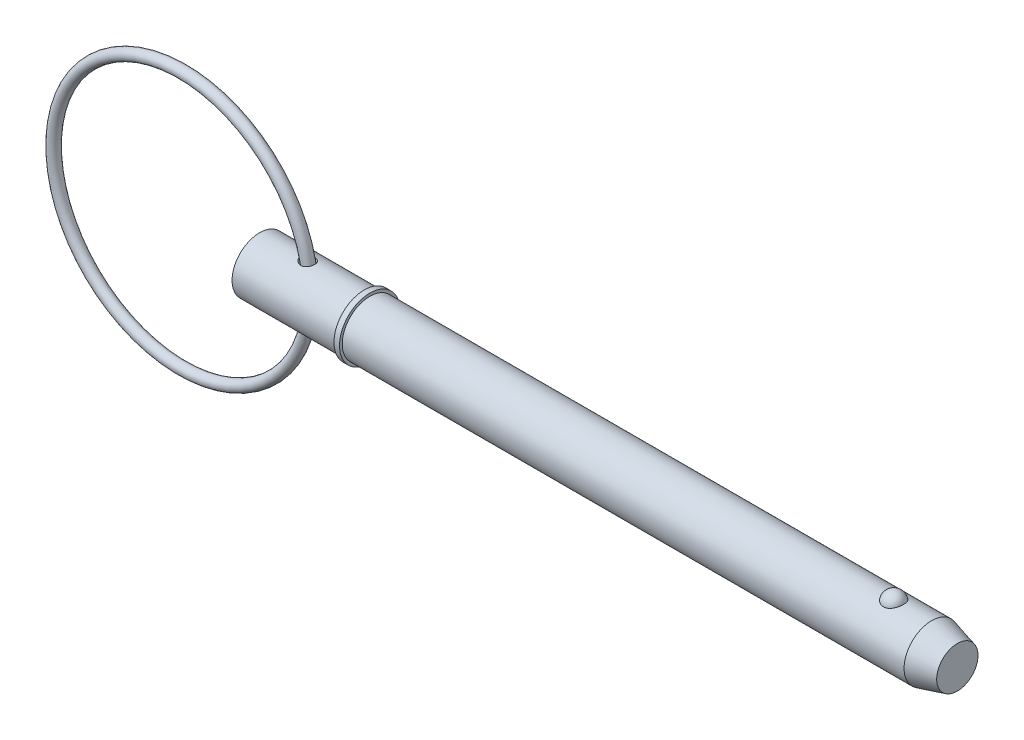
ISO-10303-21;
HEADER;
FILE_DESCRIPTION(('STEP AP214'),'2;1');
FILE_NAME('part.step','',(''),(''),'','','');
FILE_SCHEMA(('AUTOMOTIVE_DESIGN { 1 0 10303 214 1 1 1 1 }'));
ENDSEC;
DATA;
#1=APPLICATION_CONTEXT('core data for automotive mechanical design processes');
#2=APPLICATION_PROTOCOL_DEFINITION('international standard','automotive_design',2000,#1);
#3=PRODUCT_CONTEXT('',#1,'mechanical');
#4=PRODUCT('Part','Part','',(#3));
#5=PRODUCT_RELATED_PRODUCT_CATEGORY('part','',(#4));
#6=PRODUCT_DEFINITION_FORMATION('','',#4);
#7=PRODUCT_DEFINITION_CONTEXT('part definition',#1,'design');
#8=PRODUCT_DEFINITION('design','',#6,#7);
#9=PRODUCT_DEFINITION_SHAPE('','',#8);
#10=(LENGTH_UNIT() NAMED_UNIT(*) SI_UNIT(.MILLI.,.METRE.));
#11=(NAMED_UNIT(*) PLANE_ANGLE_UNIT() SI_UNIT($,.RADIAN.));
#12=(NAMED_UNIT(*) SI_UNIT($,.STERADIAN.) SOLID_ANGLE_UNIT());
#13=UNCERTAINTY_MEASURE_WITH_UNIT(LENGTH_MEASURE(1.E-05),#10,'distance_accuracy_value','');
#14=(GEOMETRIC_REPRESENTATION_CONTEXT(3) GLOBAL_UNCERTAINTY_ASSIGNED_CONTEXT((#13)) GLOBAL_UNIT_ASSIGNED_CONTEXT((#10,
#11,#12)) REPRESENTATION_CONTEXT('',''));
#15=CARTESIAN_POINT('',(0.,0.,0.));
#16=DIRECTION('',(0.,0.,1.));
#17=DIRECTION('',(1.,0.,0.));
#18=AXIS2_PLACEMENT_3D('',#15,#16,#17);
#19=CARTESIAN_POINT('',(-13.4013067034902,0.,0.));
#20=DIRECTION('',(0.,0.,1.));
#21=DIRECTION('',(1.,0.,0.));
#22=AXIS2_PLACEMENT_3D('',#19,#20,#21);
#23=TOROIDAL_SURFACE('',#22,22.225,0.952999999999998);
#24=CARTESIAN_POINT('',(9.77669329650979,0.,0.));
#25=VERTEX_POINT('',#24);
#26=VERTEX_LOOP('',#25);
#27=FACE_BOUND('',#26,.T.);
#28=ADVANCED_FACE('P0_F12',(#27),#23,.T.);
#29=CLOSED_SHELL('',(#28));
#30=MANIFOLD_SOLID_BREP('P0_B1',#29);
#31=CARTESIAN_POINT('',(0.,0.,0.));
#32=DIRECTION('',(1.,0.,0.));
#33=DIRECTION('',(0.,0.,-1.));
#34=AXIS2_PLACEMENT_3D('',#31,#32,#33);
#35=CYLINDRICAL_SURFACE('',#34,4.765);
#36=CARTESIAN_POINT('',(7.48459594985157,4.685973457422,-0.864220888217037));
#37=CARTESIAN_POINT('',(7.53849733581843,4.67711144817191,-0.912273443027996));
#38=CARTESIAN_POINT('',(7.59654891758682,4.66833039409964,-0.955745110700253));
#39=CARTESIAN_POINT('',(7.71924602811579,4.65195567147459,-1.03251233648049));
#40=CARTESIAN_POINT('',(7.78389917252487,4.64436340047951,-1.06579596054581));
#41=CARTESIAN_POINT('',(7.91808098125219,4.63129108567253,-1.12124172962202));
#42=CARTESIAN_POINT('',(7.98761280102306,4.62581242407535,-1.14339659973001));
#43=CARTESIAN_POINT('',(8.12956198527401,4.61771699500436,-1.17566870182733));
#44=CARTESIAN_POINT('',(8.20197774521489,4.61509865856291,-1.18579253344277));
#45=CARTESIAN_POINT('',(8.34550810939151,4.6131791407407,-1.19323853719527));
#46=CARTESIAN_POINT('',(8.41660306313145,4.61378793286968,-1.19090812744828));
#47=CARTESIAN_POINT('',(8.55721866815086,4.61812874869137,-1.17396277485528));
#48=CARTESIAN_POINT('',(8.62673979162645,4.62185982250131,-1.15935156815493));
#49=CARTESIAN_POINT('',(8.75801373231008,4.63172632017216,-1.11925454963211));
#50=CARTESIAN_POINT('',(8.81998342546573,4.63771186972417,-1.09443918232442));
#51=CARTESIAN_POINT('',(8.93863698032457,4.65140179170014,-1.03470792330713));
#52=CARTESIAN_POINT('',(8.99532131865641,4.65910600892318,-0.999792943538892));
#53=CARTESIAN_POINT('',(9.10080884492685,4.67519705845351,-0.921583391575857));
#54=CARTESIAN_POINT('',(9.14973848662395,4.68356861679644,-0.878455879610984));
#55=CARTESIAN_POINT('',(9.23971126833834,4.70019813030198,-0.784620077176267));
#56=CARTESIAN_POINT('',(9.28075401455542,4.7084560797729,-0.733911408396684));
#57=CARTESIAN_POINT('',(9.35441071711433,4.7240688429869,-0.62563775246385));
#58=CARTESIAN_POINT('',(9.38691359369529,4.73141115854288,-0.567995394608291));
#59=CARTESIAN_POINT('',(9.44203216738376,4.74427907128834,-0.447974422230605));
#60=CARTESIAN_POINT('',(9.46464743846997,4.74980459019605,-0.385595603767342));
#61=CARTESIAN_POINT('',(9.49961110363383,4.75848927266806,-0.257248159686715));
#62=CARTESIAN_POINT('',(9.51186382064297,4.76162635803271,-0.191251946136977));
#63=CARTESIAN_POINT('',(9.52545294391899,4.76511165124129,-0.0580729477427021));
#64=CARTESIAN_POINT('',(9.52678936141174,4.76545986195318,0.00910983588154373));
#65=CARTESIAN_POINT('',(9.51851557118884,4.76333054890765,0.142723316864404));
#66=CARTESIAN_POINT('',(9.50891008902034,4.76085424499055,0.209154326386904));
#67=CARTESIAN_POINT('',(9.47899306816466,4.75334441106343,0.339411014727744));
#68=CARTESIAN_POINT('',(9.45868126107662,4.74831081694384,0.403236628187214));
#69=CARTESIAN_POINT('',(9.4078294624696,4.73622777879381,0.526509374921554));
#70=CARTESIAN_POINT('',(9.37728413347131,4.72917728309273,0.585954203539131));
#71=CARTESIAN_POINT('',(9.30671117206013,4.71383320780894,0.698745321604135));
#72=CARTESIAN_POINT('',(9.26668347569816,4.70553961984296,0.752091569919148));
#73=CARTESIAN_POINT('',(9.17821531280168,4.68864637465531,0.851083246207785));
#74=CARTESIAN_POINT('',(9.12978756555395,4.68004719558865,0.896740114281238));
#75=CARTESIAN_POINT('',(9.02575872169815,4.66350833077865,0.97912505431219));
#76=CARTESIAN_POINT('',(8.97015856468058,4.65556855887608,1.01585429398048));
#77=CARTESIAN_POINT('',(8.85409306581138,4.6413534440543,1.0789347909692));
#78=CARTESIAN_POINT('',(8.79369898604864,4.63505812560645,1.10541268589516));
#79=CARTESIAN_POINT('',(8.66918290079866,4.62469916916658,1.1479836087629));
#80=CARTESIAN_POINT('',(8.60506121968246,4.62063533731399,1.1640775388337));
#81=CARTESIAN_POINT('',(8.47537782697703,4.61517348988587,1.18554696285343));
#82=CARTESIAN_POINT('',(8.4098281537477,4.61375835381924,1.19099130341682));
#83=CARTESIAN_POINT('',(8.2786938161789,4.61362908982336,1.19149080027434));
#84=CARTESIAN_POINT('',(8.21310914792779,4.61491539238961,1.18654430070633));
#85=CARTESIAN_POINT('',(8.08152457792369,4.62006017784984,1.16635311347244));
#86=CARTESIAN_POINT('',(8.01557748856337,4.62399895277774,1.15078675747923));
#87=CARTESIAN_POINT('',(7.88704537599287,4.63403793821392,1.10966738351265));
#88=CARTESIAN_POINT('',(7.82446148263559,4.64013886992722,1.08411103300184));
#89=CARTESIAN_POINT('',(7.70057947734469,4.65423592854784,1.02195168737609));
#90=CARTESIAN_POINT('',(7.63957197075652,4.66232221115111,0.984788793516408));
#91=CARTESIAN_POINT('',(7.52457021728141,4.67924552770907,0.900950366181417));
#92=CARTESIAN_POINT('',(7.47057819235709,4.68808279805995,0.854271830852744));
#93=CARTESIAN_POINT('',(7.37028930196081,4.70567913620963,0.751386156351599));
#94=CARTESIAN_POINT('',(7.32416327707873,4.7144333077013,0.695010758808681));
#95=CARTESIAN_POINT('',(7.24276674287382,4.73060166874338,0.574719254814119));
#96=CARTESIAN_POINT('',(7.20749051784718,4.73801656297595,0.510807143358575));
#97=CARTESIAN_POINT('',(7.15148495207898,4.75009927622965,0.381705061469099));
#98=CARTESIAN_POINT('',(7.12994463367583,4.7549169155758,0.31688231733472));
#99=CARTESIAN_POINT('',(7.09904467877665,4.76189692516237,0.184270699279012));
#100=CARTESIAN_POINT('',(7.08967554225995,4.76406136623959,0.116484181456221));
#101=CARTESIAN_POINT('',(7.08394150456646,4.76538257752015,-0.0133529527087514));
#102=CARTESIAN_POINT('',(7.0864533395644,4.76479916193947,-0.0753538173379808));
#103=CARTESIAN_POINT('',(7.10181380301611,4.76127985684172,-0.197993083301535));
#104=CARTESIAN_POINT('',(7.11466291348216,4.75834385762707,-0.258631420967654));
#105=CARTESIAN_POINT('',(7.14973937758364,4.75051877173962,-0.375744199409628));
#106=CARTESIAN_POINT('',(7.17178938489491,4.7456667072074,-0.432274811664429));
#107=CARTESIAN_POINT('',(7.22432962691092,4.73449674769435,-0.54107038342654));
#108=CARTESIAN_POINT('',(7.25481702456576,4.72817934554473,-0.593336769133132));
#109=CARTESIAN_POINT('',(7.31700895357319,4.71588241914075,-0.683642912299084));
#110=CARTESIAN_POINT('',(7.34750058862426,4.7100477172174,-0.722547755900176));
#111=CARTESIAN_POINT('',(7.41288050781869,4.69812059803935,-0.796421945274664));
#112=CARTESIAN_POINT('',(7.44776960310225,4.69202813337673,-0.831390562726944));
#113=CARTESIAN_POINT('',(7.48459594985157,4.685973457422,-0.864220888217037));
#114=B_SPLINE_CURVE_WITH_KNOTS('',3,(#36,#37,#38,#39,#40,#41,#42,#43,#44,#45,#46,#47,#48,#49,
#50,#51,#52,#53,#54,#55,#56,#57,#58,#59,#60,#61,#62,#63,#64,#65,#66,#67,#68,#69,#70,#71,#72,#73,
#74,#75,#76,#77,#78,#79,#80,#81,#82,#83,#84,#85,#86,#87,#88,#89,#90,#91,#92,#93,#94,#95,#96,#97,
#98,#99,#100,#101,#102,#103,#104,#105,#106,#107,#108,#109,#110,#111,#112,#113),.UNSPECIFIED.,
.T.,.F.,(4,2,2,2,2,2,2,2,2,2,2,2,2,2,2,2,2,2,2,2,2,2,2,2,2,2,2,2,2,2,2,2,2,2,2,2,2,2,4),(0.,
0.218078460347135,0.436411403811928,0.654886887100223,0.873242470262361,1.08553925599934,
1.2977714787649,1.49785367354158,1.6979178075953,1.8942789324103,2.09064985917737,
2.28946102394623,2.48828075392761,2.68891673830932,2.88955251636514,3.09010167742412,
3.29065586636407,3.49131482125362,3.69197512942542,3.89233421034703,4.09266707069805,
4.29043955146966,4.48819484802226,4.68466743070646,4.8811713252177,5.08390806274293,
5.28671248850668,5.50140943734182,5.71617422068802,5.93513249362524,6.15397522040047,
6.35827356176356,6.56241234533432,6.74765856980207,6.93291343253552,7.11475139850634,
7.29652829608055,7.44549570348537,7.59449062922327),.UNSPECIFIED.);
#115=CARTESIAN_POINT('',(7.48459594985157,4.685973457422,-0.864220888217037));
#116=VERTEX_POINT('',#115);
#117=EDGE_CURVE('P1_E42',#116,#116,#114,.T.);
#118=ORIENTED_EDGE('',*,*,#117,.T.);
#119=EDGE_LOOP('',(#118));
#120=FACE_BOUND('',#119,.T.);
#121=CARTESIAN_POINT('',(0.,0.,0.));
#122=DIRECTION('',(1.,0.,0.));
#123=DIRECTION('',(0.,0.,-1.));
#124=AXIS2_PLACEMENT_3D('',#121,#122,#123);
#125=CIRCLE('',#124,4.765);
#126=CARTESIAN_POINT('',(0.,0.,-4.765));
#127=VERTEX_POINT('',#126);
#128=EDGE_CURVE('P1_E9',#127,#127,#125,.T.);
#129=ORIENTED_EDGE('',*,*,#128,.T.);
#130=EDGE_LOOP('',(#129));
#131=FACE_BOUND('',#130,.T.);
#132=CARTESIAN_POINT('',(18.097,0.,0.));
#133=DIRECTION('',(1.,0.,0.));
#134=DIRECTION('',(0.,0.,-1.));
#135=AXIS2_PLACEMENT_3D('',#132,#133,#134);
#136=CIRCLE('',#135,4.765);
#137=CARTESIAN_POINT('',(18.097,0.,-4.765));
#138=VERTEX_POINT('',#137);
#139=EDGE_CURVE('P1_E25',#138,#138,#136,.T.);
#140=ORIENTED_EDGE('',*,*,#139,.F.);
#141=EDGE_LOOP('',(#140));
#142=FACE_BOUND('',#141,.T.);
#143=CARTESIAN_POINT('',(7.48459594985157,-4.685973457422,-0.864220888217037));
#144=CARTESIAN_POINT('',(7.43440944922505,-4.6942250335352,-0.819477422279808));
#145=CARTESIAN_POINT('',(7.38778663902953,-4.70255210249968,-0.77073361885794));
#146=CARTESIAN_POINT('',(7.3030968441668,-4.7184989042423,-0.666172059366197));
#147=CARTESIAN_POINT('',(7.26503010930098,-4.72611861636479,-0.610354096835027));
#148=CARTESIAN_POINT('',(7.19878266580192,-4.73983819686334,-0.492624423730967));
#149=CARTESIAN_POINT('',(7.17064194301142,-4.74593188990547,-0.430689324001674));
#150=CARTESIAN_POINT('',(7.12584349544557,-4.75581281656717,-0.3026233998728));
#151=CARTESIAN_POINT('',(7.10917889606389,-4.75960143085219,-0.236495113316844));
#152=CARTESIAN_POINT('',(7.0889853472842,-4.76421379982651,-0.106818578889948));
#153=CARTESIAN_POINT('',(7.0846333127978,-4.76522320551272,-0.0434047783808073));
#154=CARTESIAN_POINT('',(7.08693064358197,-4.7646936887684,0.0832041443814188));
#155=CARTESIAN_POINT('',(7.09357756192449,-4.76315533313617,0.146399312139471));
#156=CARTESIAN_POINT('',(7.11694629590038,-4.75784365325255,0.267709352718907));
#157=CARTESIAN_POINT('',(7.13318365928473,-4.75417793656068,0.325923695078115));
#158=CARTESIAN_POINT('',(7.17459606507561,-4.74508048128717,0.438922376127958));
#159=CARTESIAN_POINT('',(7.19977257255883,-4.73964845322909,0.493706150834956));
#160=CARTESIAN_POINT('',(7.25946789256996,-4.72725615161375,0.60111049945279));
#161=CARTESIAN_POINT('',(7.2943661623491,-4.72023663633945,0.653512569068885));
#162=CARTESIAN_POINT('',(7.37173226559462,-4.70550732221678,0.752279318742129));
#163=CARTESIAN_POINT('',(7.41420315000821,-4.69779724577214,0.798641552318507));
#164=CARTESIAN_POINT('',(7.50982312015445,-4.6816641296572,0.888551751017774));
#165=CARTESIAN_POINT('',(7.56359853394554,-4.67324162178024,0.931434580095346));
#166=CARTESIAN_POINT('',(7.67736628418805,-4.65728554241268,1.00819498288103));
#167=CARTESIAN_POINT('',(7.7373611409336,-4.64975233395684,1.04206888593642));
#168=CARTESIAN_POINT('',(7.86574076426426,-4.63599923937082,1.10169445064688));
#169=CARTESIAN_POINT('',(7.93441048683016,-4.62988111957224,1.12685968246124));
#170=CARTESIAN_POINT('',(8.07519000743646,-4.62035710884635,1.16529928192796));
#171=CARTESIAN_POINT('',(8.14729925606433,-4.61695078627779,1.1785755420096));
#172=CARTESIAN_POINT('',(8.29111621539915,-4.61341807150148,1.19232949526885));
#173=CARTESIAN_POINT('',(8.36279361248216,-4.61321655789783,1.19310032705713));
#174=CARTESIAN_POINT('',(8.50512944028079,-4.61602317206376,1.1821962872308));
#175=CARTESIAN_POINT('',(8.57578827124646,-4.61903000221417,1.17052644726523));
#176=CARTESIAN_POINT('',(8.70965757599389,-4.62766311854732,1.13589249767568));
#177=CARTESIAN_POINT('',(8.77306169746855,-4.63312492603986,1.11363308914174));
#178=CARTESIAN_POINT('',(8.8949702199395,-4.64598463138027,1.05869880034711));
#179=CARTESIAN_POINT('',(8.95347516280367,-4.65338231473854,1.02602507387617));
#180=CARTESIAN_POINT('',(9.06253415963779,-4.66906009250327,0.952097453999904));
#181=CARTESIAN_POINT('',(9.11324728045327,-4.67731427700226,0.911072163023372));
#182=CARTESIAN_POINT('',(9.20707850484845,-4.69393979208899,0.821122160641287));
#183=CARTESIAN_POINT('',(9.25019629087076,-4.70231112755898,0.772197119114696));
#184=CARTESIAN_POINT('',(9.32819072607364,-4.71835356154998,0.667239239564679));
#185=CARTESIAN_POINT('',(9.36297449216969,-4.72601623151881,0.611136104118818));
#186=CARTESIAN_POINT('',(9.42286382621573,-4.73971239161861,0.493799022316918));
#187=CARTESIAN_POINT('',(9.44796891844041,-4.74574580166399,0.432564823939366));
#188=CARTESIAN_POINT('',(9.48811605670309,-4.75559286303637,0.305990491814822));
#189=CARTESIAN_POINT('',(9.50304870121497,-4.75938232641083,0.240613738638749));
#190=CARTESIAN_POINT('',(9.5220569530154,-4.76423188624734,0.108201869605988));
#191=CARTESIAN_POINT('',(9.52613255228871,-4.76529198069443,0.0411667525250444));
#192=CARTESIAN_POINT('',(9.52332772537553,-4.76456884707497,-0.0926701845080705));
#193=CARTESIAN_POINT('',(9.51644541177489,-4.76278512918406,-0.159471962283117));
#194=CARTESIAN_POINT('',(9.49188827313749,-4.75656536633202,-0.290934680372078));
#195=CARTESIAN_POINT('',(9.47421322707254,-4.75212926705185,-0.355595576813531));
#196=CARTESIAN_POINT('',(9.42849503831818,-4.74108318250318,-0.480955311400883));
#197=CARTESIAN_POINT('',(9.4004503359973,-4.73447287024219,-0.541653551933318));
#198=CARTESIAN_POINT('',(9.33467290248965,-4.71979928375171,-0.657361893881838));
#199=CARTESIAN_POINT('',(9.29694000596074,-4.71173598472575,-0.712371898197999));
#200=CARTESIAN_POINT('',(9.2127449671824,-4.69505469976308,-0.815106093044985));
#201=CARTESIAN_POINT('',(9.1662875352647,-4.68643701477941,-0.862834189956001));
#202=CARTESIAN_POINT('',(9.06584125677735,-4.66961864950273,-0.949656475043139));
#203=CARTESIAN_POINT('',(9.01185326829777,-4.66141792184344,-0.98875164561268));
#204=CARTESIAN_POINT('',(8.8985010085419,-4.64646376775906,-1.0567894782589));
#205=CARTESIAN_POINT('',(8.83920621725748,-4.63969468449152,-1.08584444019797));
#206=CARTESIAN_POINT('',(8.71642097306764,-4.62824519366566,-1.13365785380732));
#207=CARTESIAN_POINT('',(8.65293102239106,-4.623564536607,-1.15241753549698));
#208=CARTESIAN_POINT('',(8.52421291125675,-4.61681938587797,-1.17914952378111));
#209=CARTESIAN_POINT('',(8.45900634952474,-4.6147310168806,-1.18722032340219));
#210=CARTESIAN_POINT('',(8.32811210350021,-4.61325848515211,-1.19292878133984));
#211=CARTESIAN_POINT('',(8.26242433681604,-4.61387479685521,-1.19056460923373));
#212=CARTESIAN_POINT('',(8.13057358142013,-4.6177227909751,-1.17555160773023));
#213=CARTESIAN_POINT('',(8.06444352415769,-4.62102282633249,-1.16263394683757));
#214=CARTESIAN_POINT('',(7.93513143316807,-4.62989870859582,-1.12676570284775));
#215=CARTESIAN_POINT('',(7.87194976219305,-4.6354748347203,-1.10381388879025));
#216=CARTESIAN_POINT('',(7.75155849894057,-4.64811746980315,-1.04928030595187));
#217=CARTESIAN_POINT('',(7.69423767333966,-4.65514232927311,-1.01793362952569));
#218=CARTESIAN_POINT('',(7.58503138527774,-4.67007903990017,-0.947046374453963));
#219=CARTESIAN_POINT('',(7.53314612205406,-4.67799092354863,-0.907505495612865));
#220=CARTESIAN_POINT('',(7.48459594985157,-4.685973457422,-0.864220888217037));
#221=B_SPLINE_CURVE_WITH_KNOTS('',3,(#143,#144,#145,#146,#147,#148,#149,#150,#151,#152,#153,
#154,#155,#156,#157,#158,#159,#160,#161,#162,#163,#164,#165,#166,#167,#168,#169,#170,#171,#172,
#173,#174,#175,#176,#177,#178,#179,#180,#181,#182,#183,#184,#185,#186,#187,#188,#189,#190,#191,
#192,#193,#194,#195,#196,#197,#198,#199,#200,#201,#202,#203,#204,#205,#206,#207,#208,#209,#210,
#211,#212,#213,#214,#215,#216,#217,#218,#219,#220),.UNSPECIFIED.,.T.,.F.,(4,2,2,2,2,2,2,2,2,2,2,
2,2,2,2,2,2,2,2,2,2,2,2,2,2,2,2,2,2,2,2,2,2,2,2,2,2,2,4),(0.,0.203013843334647,
0.406033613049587,0.609862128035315,0.813568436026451,1.0032929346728,1.19297523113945,
1.37380897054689,1.55467236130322,1.74393241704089,1.93326889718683,2.14025373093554,
2.3473227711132,2.566425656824,2.78549366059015,2.9994188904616,3.21325763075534,
3.41451842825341,3.61575693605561,3.81208930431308,4.00842987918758,4.20686629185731,
4.40531245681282,4.60586051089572,4.80640871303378,5.0069914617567,5.20757831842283,
5.40819535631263,5.60881581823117,5.80932827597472,6.00981790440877,6.2079863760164,
6.40613116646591,6.60243714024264,6.79877754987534,7.00028133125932,7.20180983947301,
7.39819723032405,7.59459181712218),.UNSPECIFIED.);
#222=CARTESIAN_POINT('',(7.48459594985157,-4.685973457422,-0.864220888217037));
#223=VERTEX_POINT('',#222);
#224=EDGE_CURVE('P1_E17',#223,#223,#221,.T.);
#225=ORIENTED_EDGE('',*,*,#224,.T.);
#226=EDGE_LOOP('',(#225));
#227=FACE_BOUND('',#226,.T.);
#228=ADVANCED_FACE('P1_F13',(#120,#131,#142,#227),#35,.T.);
#229=CARTESIAN_POINT('',(0.,0.,0.));
#230=DIRECTION('',(1.,0.,0.));
#231=DIRECTION('',(0.,0.,-1.));
#232=AXIS2_PLACEMENT_3D('',#229,#230,#231);
#233=CYLINDRICAL_SURFACE('',#232,4.765);
#234=CARTESIAN_POINT('',(116.204194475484,0.,0.));
#235=DIRECTION('',(1.,0.,0.));
#236=DIRECTION('',(0.,0.,-1.));
#237=AXIS2_PLACEMENT_3D('',#234,#235,#236);
#238=CIRCLE('',#237,4.765);
#239=CARTESIAN_POINT('',(116.204194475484,0.,-4.765));
#240=VERTEX_POINT('',#239);
#241=EDGE_CURVE('P1_E99',#240,#240,#238,.T.);
#242=ORIENTED_EDGE('',*,*,#241,.F.);
#243=EDGE_LOOP('',(#242));
#244=FACE_BOUND('',#243,.T.);
#245=CARTESIAN_POINT('',(19.05,0.,0.));
#246=DIRECTION('',(1.,0.,0.));
#247=DIRECTION('',(0.,0.,-1.));
#248=AXIS2_PLACEMENT_3D('',#245,#246,#247);
#249=CIRCLE('',#248,4.765);
#250=CARTESIAN_POINT('',(19.05,0.,-4.765));
#251=VERTEX_POINT('',#250);
#252=EDGE_CURVE('P1_E96',#251,#251,#249,.T.);
#253=ORIENTED_EDGE('',*,*,#252,.T.);
#254=EDGE_LOOP('',(#253));
#255=FACE_BOUND('',#254,.T.);
#256=CARTESIAN_POINT('',(109.651020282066,4.42764777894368,1.76101111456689));
#257=CARTESIAN_POINT('',(109.559721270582,4.42764470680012,1.76101422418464));
#258=CARTESIAN_POINT('',(109.468446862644,4.43059091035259,1.7536634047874));
#259=CARTESIAN_POINT('',(109.288615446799,4.44201846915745,1.72451180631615));
#260=CARTESIAN_POINT('',(109.200057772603,4.45049845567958,1.70271460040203));
#261=CARTESIAN_POINT('',(109.028257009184,4.47200516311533,1.64539370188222));
#262=CARTESIAN_POINT('',(108.945006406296,4.48502527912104,1.60988994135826));
#263=CARTESIAN_POINT('',(108.785763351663,4.51419542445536,1.52617873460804));
#264=CARTESIAN_POINT('',(108.709772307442,4.53034605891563,1.47796883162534));
#265=CARTESIAN_POINT('',(108.564744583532,4.56459317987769,1.36860494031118));
#266=CARTESIAN_POINT('',(108.495964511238,4.58273170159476,1.3071242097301));
#267=CARTESIAN_POINT('',(108.369342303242,4.61870302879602,1.17370204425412));
#268=CARTESIAN_POINT('',(108.311502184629,4.63653577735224,1.10175868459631));
#269=CARTESIAN_POINT('',(108.205570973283,4.67090140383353,0.945806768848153));
#270=CARTESIAN_POINT('',(108.158030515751,4.68734068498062,0.861402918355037));
#271=CARTESIAN_POINT('',(108.077081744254,4.71628466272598,0.685442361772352));
#272=CARTESIAN_POINT('',(108.043674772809,4.72878898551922,0.593884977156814));
#273=CARTESIAN_POINT('',(107.991287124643,4.74874061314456,0.404781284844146));
#274=CARTESIAN_POINT('',(107.972517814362,4.75611366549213,0.307168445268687));
#275=CARTESIAN_POINT('',(107.950584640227,4.76475393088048,0.10994090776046));
#276=CARTESIAN_POINT('',(107.947420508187,4.76602124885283,0.0103262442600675));
#277=CARTESIAN_POINT('',(107.956740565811,4.76232928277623,-0.187629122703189));
#278=CARTESIAN_POINT('',(107.969158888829,4.7573962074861,-0.285973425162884));
#279=CARTESIAN_POINT('',(108.009280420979,4.74184975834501,-0.47902728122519));
#280=CARTESIAN_POINT('',(108.036983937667,4.7312362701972,-0.573736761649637));
#281=CARTESIAN_POINT('',(108.107158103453,4.70540026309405,-0.756973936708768));
#282=CARTESIAN_POINT('',(108.149646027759,4.69017235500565,-0.8454942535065));
#283=CARTESIAN_POINT('',(108.248520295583,4.6566986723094,-1.01378033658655));
#284=CARTESIAN_POINT('',(108.304907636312,4.63845268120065,-1.09354547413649));
#285=CARTESIAN_POINT('',(108.430552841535,4.60085438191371,-1.24228523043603));
#286=CARTESIAN_POINT('',(108.499843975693,4.58149930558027,-1.31123108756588));
#287=CARTESIAN_POINT('',(108.649606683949,4.54391653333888,-1.43607409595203));
#288=CARTESIAN_POINT('',(108.730077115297,4.52568872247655,-1.4919725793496));
#289=CARTESIAN_POINT('',(108.898150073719,4.49293007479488,-1.58786764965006));
#290=CARTESIAN_POINT('',(108.985544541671,4.47832346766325,-1.62820219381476));
#291=CARTESIAN_POINT('',(109.166553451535,4.45406011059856,-1.69345757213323));
#292=CARTESIAN_POINT('',(109.26016555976,4.44440151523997,-1.71838415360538));
#293=CARTESIAN_POINT('',(109.445893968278,4.43159888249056,-1.75112843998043));
#294=CARTESIAN_POINT('',(109.537849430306,4.42815213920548,-1.75974223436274));
#295=CARTESIAN_POINT('',(109.721965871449,4.42724735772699,-1.76201865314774));
#296=CARTESIAN_POINT('',(109.814126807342,4.42978816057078,-1.75568417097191));
#297=CARTESIAN_POINT('',(109.993129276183,4.44038648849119,-1.72869560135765));
#298=CARTESIAN_POINT('',(110.080047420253,4.44827555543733,-1.70847853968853));
#299=CARTESIAN_POINT('',(110.249131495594,4.46852246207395,-1.65479562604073));
#300=CARTESIAN_POINT('',(110.331297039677,4.48088066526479,-1.62132869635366));
#301=CARTESIAN_POINT('',(110.490591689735,4.50907357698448,-1.54120560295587));
#302=CARTESIAN_POINT('',(110.567570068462,4.52497884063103,-1.49427526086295));
#303=CARTESIAN_POINT('',(110.712708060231,4.55845148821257,-1.38881222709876));
#304=CARTESIAN_POINT('',(110.780865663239,4.57601924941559,-1.33027689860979));
#305=CARTESIAN_POINT('',(110.910099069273,4.61196537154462,-1.1999104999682));
#306=CARTESIAN_POINT('',(110.970656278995,4.63034074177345,-1.12756415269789));
#307=CARTESIAN_POINT('',(111.079279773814,4.66513959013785,-0.973612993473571));
#308=CARTESIAN_POINT('',(111.127343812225,4.68156271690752,-0.892006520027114));
#309=CARTESIAN_POINT('',(111.211383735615,4.71130224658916,-0.718892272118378));
#310=CARTESIAN_POINT('',(111.246918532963,4.724501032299,-0.627149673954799));
#311=CARTESIAN_POINT('',(111.302952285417,4.74571823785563,-0.438611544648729));
#312=CARTESIAN_POINT('',(111.323450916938,4.75373654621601,-0.341815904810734));
#313=CARTESIAN_POINT('',(111.349033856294,4.76378905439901,-0.14563306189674));
#314=CARTESIAN_POINT('',(111.354076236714,4.76580697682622,-0.0462395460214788));
#315=CARTESIAN_POINT('',(111.348523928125,4.76360573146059,0.152038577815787));
#316=CARTESIAN_POINT('',(111.337929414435,4.75938663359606,0.250923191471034));
#317=CARTESIAN_POINT('',(111.301387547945,4.74516937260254,0.445004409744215));
#318=CARTESIAN_POINT('',(111.275496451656,4.73519238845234,0.54021317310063));
#319=CARTESIAN_POINT('',(111.208927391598,4.7104939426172,0.724662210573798));
#320=CARTESIAN_POINT('',(111.168248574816,4.69577220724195,0.813902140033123));
#321=CARTESIAN_POINT('',(111.072717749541,4.66303767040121,0.984313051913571));
#322=CARTESIAN_POINT('',(111.017804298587,4.64501070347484,1.06544688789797));
#323=CARTESIAN_POINT('',(110.895049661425,4.60764678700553,1.21692673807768));
#324=CARTESIAN_POINT('',(110.827208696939,4.58830985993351,1.28727293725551));
#325=CARTESIAN_POINT('',(110.680548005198,4.55060370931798,1.41479271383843));
#326=CARTESIAN_POINT('',(110.601791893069,4.53222967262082,1.47203785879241));
#327=CARTESIAN_POINT('',(110.434989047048,4.49849576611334,1.57212016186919));
#328=CARTESIAN_POINT('',(110.346941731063,4.48313608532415,1.61495641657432));
#329=CARTESIAN_POINT('',(110.159791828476,4.45676184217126,1.68642657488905));
#330=CARTESIAN_POINT('',(110.060365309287,4.44598302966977,1.71430590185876));
#331=CARTESIAN_POINT('',(109.857621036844,4.43142918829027,1.75159258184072));
#332=CARTESIAN_POINT('',(109.754304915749,4.42765125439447,1.76100759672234));
#333=CARTESIAN_POINT('',(109.651020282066,4.42764777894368,1.76101111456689));
#334=B_SPLINE_CURVE_WITH_KNOTS('',3,(#256,#257,#258,#259,#260,#261,#262,#263,#264,#265,#266,
#267,#268,#269,#270,#271,#272,#273,#274,#275,#276,#277,#278,#279,#280,#281,#282,#283,#284,#285,
#286,#287,#288,#289,#290,#291,#292,#293,#294,#295,#296,#297,#298,#299,#300,#301,#302,#303,#304,
#305,#306,#307,#308,#309,#310,#311,#312,#313,#314,#315,#316,#317,#318,#319,#320,#321,#322,#323,
#324,#325,#326,#327,#328,#329,#330,#331,#332,#333),.UNSPECIFIED.,.T.,.F.,(4,2,2,2,2,2,2,2,2,2,2,
2,2,2,2,2,2,2,2,2,2,2,2,2,2,2,2,2,2,2,2,2,2,2,2,2,2,2,4),(0.,0.273517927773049,
0.546968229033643,0.820022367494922,1.09312934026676,1.37393946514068,1.65480131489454,
1.94820420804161,2.24163496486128,2.5392281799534,2.83681628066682,3.13315071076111,
3.429491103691,3.72617893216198,4.02288805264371,4.32037303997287,4.61782764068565,
4.90840095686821,5.1988658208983,5.47474855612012,5.75057789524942,6.0180997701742,
6.28564340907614,6.55907787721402,6.83257454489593,7.11962987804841,7.40673679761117,
7.7031266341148,7.99952284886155,8.29672237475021,8.59391856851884,8.89002850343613,
9.18615552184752,9.48358266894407,9.78100471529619,10.0767610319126,10.3725358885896,
10.6820893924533,10.9915144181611),.UNSPECIFIED.);
#335=CARTESIAN_POINT('',(109.651020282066,4.42764777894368,1.76101111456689));
#336=VERTEX_POINT('',#335);
#337=EDGE_CURVE('P1_E34',#336,#336,#334,.T.);
#338=ORIENTED_EDGE('',*,*,#337,.T.);
#339=EDGE_LOOP('',(#338));
#340=FACE_BOUND('',#339,.T.);
#341=ADVANCED_FACE('P1_F46',(#244,#255,#340),#233,.T.);
#342=CARTESIAN_POINT('',(0.,0.,0.));
#343=DIRECTION('',(-1.,0.,0.));
#344=DIRECTION('',(0.,0.,1.));
#345=AXIS2_PLACEMENT_3D('',#342,#343,#344);
#346=PLANE('',#345);
#347=ORIENTED_EDGE('',*,*,#128,.F.);
#348=EDGE_LOOP('',(#347));
#349=FACE_BOUND('',#348,.T.);
#350=ADVANCED_FACE('P1_F15',(#349),#346,.T.);
#351=CARTESIAN_POINT('',(18.097,4.765,0.));
#352=DIRECTION('',(-1.,0.,0.));
#353=DIRECTION('',(0.,0.,1.));
#354=AXIS2_PLACEMENT_3D('',#351,#352,#353);
#355=PLANE('',#354);
#356=ORIENTED_EDGE('',*,*,#139,.T.);
#357=EDGE_LOOP('',(#356));
#358=FACE_BOUND('',#357,.T.);
#359=CARTESIAN_POINT('',(18.097,0.,0.));
#360=DIRECTION('',(1.,0.,0.));
#361=DIRECTION('',(0.,0.,-1.));
#362=AXIS2_PLACEMENT_3D('',#359,#360,#361);
#363=CIRCLE('',#362,5.2415);
#364=CARTESIAN_POINT('',(18.097,0.,-5.2415));
#365=VERTEX_POINT('',#364);
#366=EDGE_CURVE('P1_E30',#365,#365,#363,.T.);
#367=ORIENTED_EDGE('',*,*,#366,.F.);
#368=EDGE_LOOP('',(#367));
#369=FACE_BOUND('',#368,.T.);
#370=ADVANCED_FACE('P1_F81',(#358,#369),#355,.T.);
#371=CARTESIAN_POINT('',(0.,0.,0.));
#372=DIRECTION('',(1.,0.,0.));
#373=DIRECTION('',(0.,0.,-1.));
#374=AXIS2_PLACEMENT_3D('',#371,#372,#373);
#375=CYLINDRICAL_SURFACE('',#374,5.2415);
#376=ORIENTED_EDGE('',*,*,#366,.T.);
#377=EDGE_LOOP('',(#376));
#378=FACE_BOUND('',#377,.T.);
#379=CARTESIAN_POINT('',(19.05,0.,0.));
#380=DIRECTION('',(1.,0.,0.));
#381=DIRECTION('',(0.,0.,-1.));
#382=AXIS2_PLACEMENT_3D('',#379,#380,#381);
#383=CIRCLE('',#382,5.2415);
#384=CARTESIAN_POINT('',(19.05,0.,-5.2415));
#385=VERTEX_POINT('',#384);
#386=EDGE_CURVE('P1_E95',#385,#385,#383,.T.);
#387=ORIENTED_EDGE('',*,*,#386,.F.);
#388=EDGE_LOOP('',(#387));
#389=FACE_BOUND('',#388,.T.);
#390=ADVANCED_FACE('P1_F68',(#378,#389),#375,.T.);
#391=CARTESIAN_POINT('',(19.05,5.2415,0.));
#392=DIRECTION('',(1.,0.,0.));
#393=DIRECTION('',(0.,0.,-1.));
#394=AXIS2_PLACEMENT_3D('',#391,#392,#393);
#395=PLANE('',#394);
#396=ORIENTED_EDGE('',*,*,#386,.T.);
#397=EDGE_LOOP('',(#396));
#398=FACE_BOUND('',#397,.T.);
#399=ORIENTED_EDGE('',*,*,#252,.F.);
#400=EDGE_LOOP('',(#399));
#401=FACE_BOUND('',#400,.T.);
#402=ADVANCED_FACE('P1_F62',(#398,#401),#395,.T.);
#403=CARTESIAN_POINT('',(120.65,0.,0.));
#404=DIRECTION('',(-1.,0.,0.));
#405=DIRECTION('',(0.,0.,1.));
#406=AXIS2_PLACEMENT_3D('',#403,#404,#405);
#407=CONICAL_SURFACE('',#406,3.57375000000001,0.261799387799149);
#408=ORIENTED_EDGE('',*,*,#241,.T.);
#409=EDGE_LOOP('',(#408));
#410=FACE_BOUND('',#409,.T.);
#411=CARTESIAN_POINT('',(120.65,0.,0.));
#412=DIRECTION('',(1.,0.,0.));
#413=DIRECTION('',(0.,0.,-1.));
#414=AXIS2_PLACEMENT_3D('',#411,#412,#413);
#415=CIRCLE('',#414,3.57375000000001);
#416=CARTESIAN_POINT('',(120.65,0.,-3.57375000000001));
#417=VERTEX_POINT('',#416);
#418=EDGE_CURVE('P1_E41',#417,#417,#415,.T.);
#419=ORIENTED_EDGE('',*,*,#418,.F.);
#420=EDGE_LOOP('',(#419));
#421=FACE_BOUND('',#420,.T.);
#422=ADVANCED_FACE('P1_F59',(#410,#421),#407,.T.);
#423=CARTESIAN_POINT('',(120.65,3.57375000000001,0.));
#424=DIRECTION('',(1.,0.,0.));
#425=DIRECTION('',(0.,0.,-1.));
#426=AXIS2_PLACEMENT_3D('',#423,#424,#425);
#427=PLANE('',#426);
#428=ORIENTED_EDGE('',*,*,#418,.T.);
#429=EDGE_LOOP('',(#428));
#430=FACE_BOUND('',#429,.T.);
#431=ADVANCED_FACE('P1_F55',(#430),#427,.T.);
#432=CARTESIAN_POINT('',(109.651020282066,4.28849999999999,0.));
#433=DIRECTION('',(-1.,0.,0.));
#434=DIRECTION('',(0.,-1.,0.));
#435=AXIS2_PLACEMENT_3D('',#432,#433,#434);
#436=SPHERICAL_SURFACE('',#435,1.76650000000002);
#437=ORIENTED_EDGE('',*,*,#337,.F.);
#438=EDGE_LOOP('',(#437));
#439=FACE_BOUND('',#438,.T.);
#440=ADVANCED_FACE('P1_F50',(#439),#436,.T.);
#441=CARTESIAN_POINT('',(-13.4013067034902,0.,0.));
#442=DIRECTION('',(0.,0.,1.));
#443=DIRECTION('',(1.,0.,0.));
#444=AXIS2_PLACEMENT_3D('',#441,#442,#443);
#445=TOROIDAL_SURFACE('',#444,22.225,1.19125);
#446=ORIENTED_EDGE('',*,*,#224,.F.);
#447=EDGE_LOOP('',(#446));
#448=FACE_BOUND('',#447,.T.);
#449=ORIENTED_EDGE('',*,*,#117,.F.);
#450=EDGE_LOOP('',(#449));
#451=FACE_BOUND('',#450,.T.);
#452=ADVANCED_FACE('P1_F54',(#448,#451),#445,.F.);
#453=CLOSED_SHELL('',(#228,#341,#350,#370,#390,#402,#422,#431,#440,#452));
#454=MANIFOLD_SOLID_BREP('P1_B1',#453);
#455=ADVANCED_BREP_SHAPE_REPRESENTATION('',(#18,#30,#454),#14);
#456=SHAPE_DEFINITION_REPRESENTATION(#9,#455);
ENDSEC;
END-ISO-10303-21;
